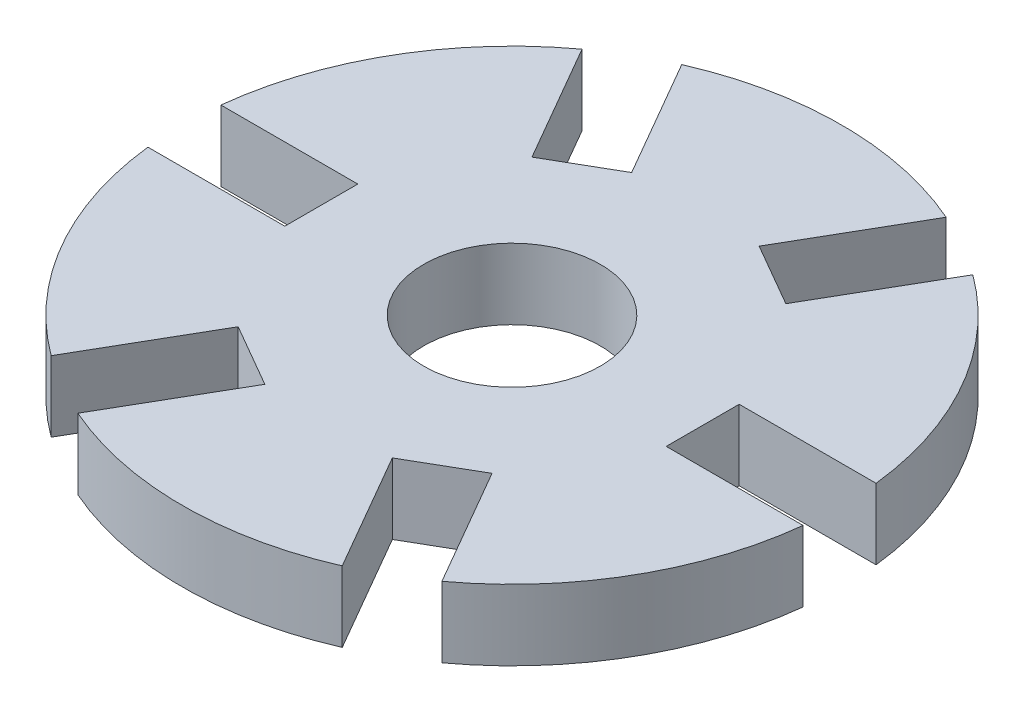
ISO-10303-21;
HEADER;
FILE_DESCRIPTION(('STEP AP214'),'2;1');
FILE_NAME('part.step','',(''),(''),'','','');
FILE_SCHEMA(('AUTOMOTIVE_DESIGN { 1 0 10303 214 1 1 1 1 }'));
ENDSEC;
DATA;
#1=APPLICATION_CONTEXT('core data for automotive mechanical design processes');
#2=APPLICATION_PROTOCOL_DEFINITION('international standard','automotive_design',2000,#1);
#3=PRODUCT_CONTEXT('',#1,'mechanical');
#4=PRODUCT('Part','Part','',(#3));
#5=PRODUCT_RELATED_PRODUCT_CATEGORY('part','',(#4));
#6=PRODUCT_DEFINITION_FORMATION('','',#4);
#7=PRODUCT_DEFINITION_CONTEXT('part definition',#1,'design');
#8=PRODUCT_DEFINITION('design','',#6,#7);
#9=PRODUCT_DEFINITION_SHAPE('','',#8);
#10=(LENGTH_UNIT() NAMED_UNIT(*) SI_UNIT(.MILLI.,.METRE.));
#11=(NAMED_UNIT(*) PLANE_ANGLE_UNIT() SI_UNIT($,.RADIAN.));
#12=(NAMED_UNIT(*) SI_UNIT($,.STERADIAN.) SOLID_ANGLE_UNIT());
#13=UNCERTAINTY_MEASURE_WITH_UNIT(LENGTH_MEASURE(1.E-05),#10,'distance_accuracy_value','');
#14=(GEOMETRIC_REPRESENTATION_CONTEXT(3) GLOBAL_UNCERTAINTY_ASSIGNED_CONTEXT((#13)) GLOBAL_UNIT_ASSIGNED_CONTEXT((#10,
#11,#12)) REPRESENTATION_CONTEXT('',''));
#15=CARTESIAN_POINT('',(0.,0.,0.));
#16=DIRECTION('',(0.,0.,1.));
#17=DIRECTION('',(1.,0.,0.));
#18=AXIS2_PLACEMENT_3D('',#15,#16,#17);
#19=CARTESIAN_POINT('',(0.,6.,0.));
#20=DIRECTION('',(0.,-1.,0.));
#21=DIRECTION('',(0.,0.,-1.));
#22=AXIS2_PLACEMENT_3D('',#19,#20,#21);
#23=CYLINDRICAL_SURFACE('',#22,28.);
#24=CARTESIAN_POINT('',(0.,6.,0.));
#25=DIRECTION('',(0.,1.,0.));
#26=DIRECTION('',(0.,0.,-1.));
#27=AXIS2_PLACEMENT_3D('',#24,#25,#26);
#28=CIRCLE('',#27,28.);
#29=CARTESIAN_POINT('',(16.5986106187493,6.,22.5496369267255));
#30=VERTEX_POINT('',#29);
#31=CARTESIAN_POINT('',(27.8278637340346,6.,3.1));
#32=VERTEX_POINT('',#31);
#33=EDGE_CURVE('E57',#30,#32,#28,.T.);
#34=ORIENTED_EDGE('',*,*,#33,.F.);
#35=DIRECTION('',(0.,-1.,0.));
#36=VECTOR('',#35,1.);
#37=CARTESIAN_POINT('',(16.5986106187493,6.,22.5496369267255));
#38=LINE('',#37,#36);
#39=CARTESIAN_POINT('',(16.5986106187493,0.,22.5496369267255));
#40=VERTEX_POINT('',#39);
#41=EDGE_CURVE('E297',#40,#30,#38,.F.);
#42=ORIENTED_EDGE('',*,*,#41,.F.);
#43=CARTESIAN_POINT('',(0.,0.,0.));
#44=DIRECTION('',(0.,1.,0.));
#45=DIRECTION('',(0.,0.,-1.));
#46=AXIS2_PLACEMENT_3D('',#43,#44,#45);
#47=CIRCLE('',#46,28.);
#48=CARTESIAN_POINT('',(27.8278637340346,0.,3.1));
#49=VERTEX_POINT('',#48);
#50=EDGE_CURVE('E387',#40,#49,#47,.T.);
#51=ORIENTED_EDGE('',*,*,#50,.T.);
#52=DIRECTION('',(0.,-1.,0.));
#53=VECTOR('',#52,1.);
#54=CARTESIAN_POINT('',(27.8278637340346,6.,3.1));
#55=LINE('',#54,#53);
#56=EDGE_CURVE('E354',#32,#49,#55,.T.);
#57=ORIENTED_EDGE('',*,*,#56,.F.);
#58=EDGE_LOOP('',(#34,#42,#51,#57));
#59=FACE_BOUND('',#58,.T.);
#60=ADVANCED_FACE('F46',(#59),#23,.T.);
#61=CARTESIAN_POINT('',(-11.2292531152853,0.,25.6496369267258));
#62=VERTEX_POINT('',#61);
#63=CARTESIAN_POINT('',(11.2292531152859,0.,25.6496369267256));
#64=VERTEX_POINT('',#63);
#65=EDGE_CURVE('E390',#62,#64,#47,.T.);
#66=ORIENTED_EDGE('',*,*,#65,.T.);
#67=DIRECTION('',(0.,-1.,0.));
#68=VECTOR('',#67,1.);
#69=CARTESIAN_POINT('',(11.2292531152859,6.,25.6496369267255));
#70=LINE('',#69,#68);
#71=CARTESIAN_POINT('',(11.2292531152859,6.,25.6496369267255));
#72=VERTEX_POINT('',#71);
#73=EDGE_CURVE('E295',#72,#64,#70,.T.);
#74=ORIENTED_EDGE('',*,*,#73,.F.);
#75=CARTESIAN_POINT('',(-11.2292531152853,6.,25.6496369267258));
#76=VERTEX_POINT('',#75);
#77=EDGE_CURVE('E424',#76,#72,#28,.T.);
#78=ORIENTED_EDGE('',*,*,#77,.F.);
#79=DIRECTION('',(0.,-1.,0.));
#80=VECTOR('',#79,1.);
#81=CARTESIAN_POINT('',(-11.2292531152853,6.,25.6496369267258));
#82=LINE('',#81,#80);
#83=EDGE_CURVE('E449',#62,#76,#82,.F.);
#84=ORIENTED_EDGE('',*,*,#83,.F.);
#85=EDGE_LOOP('',(#66,#74,#78,#84));
#86=FACE_BOUND('',#85,.T.);
#87=ADVANCED_FACE('F408',(#86),#23,.T.);
#88=CARTESIAN_POINT('',(-27.8278637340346,0.,3.1));
#89=VERTEX_POINT('',#88);
#90=CARTESIAN_POINT('',(-16.5986106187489,0.,22.5496369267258));
#91=VERTEX_POINT('',#90);
#92=EDGE_CURVE('E434',#89,#91,#47,.T.);
#93=ORIENTED_EDGE('',*,*,#92,.T.);
#94=DIRECTION('',(0.,-1.,0.));
#95=VECTOR('',#94,1.);
#96=CARTESIAN_POINT('',(-16.5986106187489,6.,22.5496369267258));
#97=LINE('',#96,#95);
#98=CARTESIAN_POINT('',(-16.5986106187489,6.,22.5496369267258));
#99=VERTEX_POINT('',#98);
#100=EDGE_CURVE('E324',#99,#91,#97,.T.);
#101=ORIENTED_EDGE('',*,*,#100,.F.);
#102=CARTESIAN_POINT('',(-27.8278637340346,6.,3.1));
#103=VERTEX_POINT('',#102);
#104=EDGE_CURVE('E245',#103,#99,#28,.T.);
#105=ORIENTED_EDGE('',*,*,#104,.F.);
#106=DIRECTION('',(0.,-1.,0.));
#107=VECTOR('',#106,1.);
#108=CARTESIAN_POINT('',(-27.8278637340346,6.,3.1));
#109=LINE('',#108,#107);
#110=EDGE_CURVE('E496',#89,#103,#109,.F.);
#111=ORIENTED_EDGE('',*,*,#110,.F.);
#112=EDGE_LOOP('',(#93,#101,#105,#111));
#113=FACE_BOUND('',#112,.T.);
#114=ADVANCED_FACE('F414',(#113),#23,.T.);
#115=CARTESIAN_POINT('',(-16.5986106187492,0.,-22.5496369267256));
#116=VERTEX_POINT('',#115);
#117=CARTESIAN_POINT('',(-27.8278637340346,0.,-3.1));
#118=VERTEX_POINT('',#117);
#119=EDGE_CURVE('E432',#116,#118,#47,.T.);
#120=ORIENTED_EDGE('',*,*,#119,.T.);
#121=DIRECTION('',(0.,-1.,0.));
#122=VECTOR('',#121,1.);
#123=CARTESIAN_POINT('',(-27.8278637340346,6.,-3.1));
#124=LINE('',#123,#122);
#125=CARTESIAN_POINT('',(-27.8278637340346,6.,-3.1));
#126=VERTEX_POINT('',#125);
#127=EDGE_CURVE('E294',#126,#118,#124,.T.);
#128=ORIENTED_EDGE('',*,*,#127,.F.);
#129=CARTESIAN_POINT('',(-16.5986106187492,6.,-22.5496369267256));
#130=VERTEX_POINT('',#129);
#131=EDGE_CURVE('E241',#130,#126,#28,.T.);
#132=ORIENTED_EDGE('',*,*,#131,.F.);
#133=DIRECTION('',(0.,-1.,0.));
#134=VECTOR('',#133,1.);
#135=CARTESIAN_POINT('',(-16.5986106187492,6.,-22.5496369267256));
#136=LINE('',#135,#134);
#137=EDGE_CURVE('E231',#116,#130,#136,.F.);
#138=ORIENTED_EDGE('',*,*,#137,.F.);
#139=EDGE_LOOP('',(#120,#128,#132,#138));
#140=FACE_BOUND('',#139,.T.);
#141=ADVANCED_FACE('F533',(#140),#23,.T.);
#142=CARTESIAN_POINT('',(11.2292531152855,0.,-25.6496369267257));
#143=VERTEX_POINT('',#142);
#144=CARTESIAN_POINT('',(-11.2292531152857,0.,-25.6496369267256));
#145=VERTEX_POINT('',#144);
#146=EDGE_CURVE('E230',#143,#145,#47,.T.);
#147=ORIENTED_EDGE('',*,*,#146,.T.);
#148=DIRECTION('',(0.,-1.,0.));
#149=VECTOR('',#148,1.);
#150=CARTESIAN_POINT('',(-11.2292531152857,6.,-25.6496369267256));
#151=LINE('',#150,#149);
#152=CARTESIAN_POINT('',(-11.2292531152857,6.,-25.6496369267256));
#153=VERTEX_POINT('',#152);
#154=EDGE_CURVE('E212',#153,#145,#151,.T.);
#155=ORIENTED_EDGE('',*,*,#154,.F.);
#156=CARTESIAN_POINT('',(11.2292531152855,6.,-25.6496369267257));
#157=VERTEX_POINT('',#156);
#158=EDGE_CURVE('E56',#157,#153,#28,.T.);
#159=ORIENTED_EDGE('',*,*,#158,.F.);
#160=DIRECTION('',(0.,-1.,0.));
#161=VECTOR('',#160,1.);
#162=CARTESIAN_POINT('',(11.2292531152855,6.,-25.6496369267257));
#163=LINE('',#162,#161);
#164=EDGE_CURVE('E327',#143,#157,#163,.F.);
#165=ORIENTED_EDGE('',*,*,#164,.F.);
#166=EDGE_LOOP('',(#147,#155,#159,#165));
#167=FACE_BOUND('',#166,.T.);
#168=ADVANCED_FACE('F227',(#167),#23,.T.);
#169=CARTESIAN_POINT('',(27.8278637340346,0.,-3.1));
#170=VERTEX_POINT('',#169);
#171=CARTESIAN_POINT('',(16.598610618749,0.,-22.5496369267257));
#172=VERTEX_POINT('',#171);
#173=EDGE_CURVE('E50',#170,#172,#47,.T.);
#174=ORIENTED_EDGE('',*,*,#173,.T.);
#175=DIRECTION('',(0.,-1.,0.));
#176=VECTOR('',#175,1.);
#177=CARTESIAN_POINT('',(16.598610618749,6.,-22.5496369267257));
#178=LINE('',#177,#176);
#179=CARTESIAN_POINT('',(16.598610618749,6.,-22.5496369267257));
#180=VERTEX_POINT('',#179);
#181=EDGE_CURVE('E325',#180,#172,#178,.T.);
#182=ORIENTED_EDGE('',*,*,#181,.F.);
#183=CARTESIAN_POINT('',(27.8278637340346,6.,-3.1));
#184=VERTEX_POINT('',#183);
#185=EDGE_CURVE('E12',#184,#180,#28,.T.);
#186=ORIENTED_EDGE('',*,*,#185,.F.);
#187=DIRECTION('',(0.,-1.,0.));
#188=VECTOR('',#187,1.);
#189=CARTESIAN_POINT('',(27.8278637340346,6.,-3.1));
#190=LINE('',#189,#188);
#191=EDGE_CURVE('E357',#170,#184,#190,.F.);
#192=ORIENTED_EDGE('',*,*,#191,.F.);
#193=EDGE_LOOP('',(#174,#182,#186,#192));
#194=FACE_BOUND('',#193,.T.);
#195=ADVANCED_FACE('F48',(#194),#23,.T.);
#196=CARTESIAN_POINT('',(0.,6.,0.));
#197=DIRECTION('',(0.,-1.,0.));
#198=DIRECTION('',(0.,0.,-1.));
#199=AXIS2_PLACEMENT_3D('',#196,#197,#198);
#200=PLANE('',#199);
#201=CARTESIAN_POINT('',(0.,6.,0.));
#202=DIRECTION('',(0.,1.,0.));
#203=DIRECTION('',(0.,0.,1.));
#204=AXIS2_PLACEMENT_3D('',#201,#202,#203);
#205=CIRCLE('',#204,7.5);
#206=CARTESIAN_POINT('',(0.,6.,7.5));
#207=VERTEX_POINT('',#206);
#208=EDGE_CURVE('E248',#207,#207,#205,.T.);
#209=ORIENTED_EDGE('',*,*,#208,.F.);
#210=EDGE_LOOP('',(#209));
#211=FACE_BOUND('',#210,.T.);
#212=DIRECTION('',(-0.866025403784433,0.,0.50000000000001));
#213=VECTOR('',#212,1.);
#214=CARTESIAN_POINT('',(10.7846787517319,6.,12.4796115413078));
#215=LINE('',#214,#213);
#216=CARTESIAN_POINT('',(10.7846787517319,6.,12.4796115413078));
#217=VERTEX_POINT('',#216);
#218=CARTESIAN_POINT('',(5.41532124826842,6.,15.5796115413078));
#219=VERTEX_POINT('',#218);
#220=EDGE_CURVE('E305',#217,#219,#215,.T.);
#221=ORIENTED_EDGE('',*,*,#220,.F.);
#222=DIRECTION('',(-0.50000000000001,0.,-0.866025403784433));
#223=VECTOR('',#222,1.);
#224=CARTESIAN_POINT('',(10.7846787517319,6.,12.4796115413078));
#225=LINE('',#224,#223);
#226=EDGE_CURVE('E314',#30,#217,#225,.T.);
#227=ORIENTED_EDGE('',*,*,#226,.F.);
#228=ORIENTED_EDGE('',*,*,#33,.T.);
#229=DIRECTION('',(1.,0.,0.));
#230=VECTOR('',#229,1.);
#231=CARTESIAN_POINT('',(16.2,6.,3.1));
#232=LINE('',#231,#230);
#233=CARTESIAN_POINT('',(16.2,6.,3.1));
#234=VERTEX_POINT('',#233);
#235=EDGE_CURVE('E370',#234,#32,#232,.T.);
#236=ORIENTED_EDGE('',*,*,#235,.F.);
#237=DIRECTION('',(0.,0.,1.));
#238=VECTOR('',#237,1.);
#239=CARTESIAN_POINT('',(16.2,6.,-3.1));
#240=LINE('',#239,#238);
#241=CARTESIAN_POINT('',(16.2,6.,-3.1));
#242=VERTEX_POINT('',#241);
#243=EDGE_CURVE('E365',#242,#234,#240,.T.);
#244=ORIENTED_EDGE('',*,*,#243,.F.);
#245=DIRECTION('',(-1.,0.,0.));
#246=VECTOR('',#245,1.);
#247=CARTESIAN_POINT('',(16.2,6.,-3.1));
#248=LINE('',#247,#246);
#249=EDGE_CURVE('E374',#184,#242,#248,.T.);
#250=ORIENTED_EDGE('',*,*,#249,.F.);
#251=ORIENTED_EDGE('',*,*,#185,.T.);
#252=DIRECTION('',(0.499999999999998,0.,-0.86602540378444));
#253=VECTOR('',#252,1.);
#254=CARTESIAN_POINT('',(10.7846787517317,6.,-12.4796115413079));
#255=LINE('',#254,#253);
#256=CARTESIAN_POINT('',(10.7846787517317,6.,-12.4796115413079));
#257=VERTEX_POINT('',#256);
#258=EDGE_CURVE('E341',#257,#180,#255,.T.);
#259=ORIENTED_EDGE('',*,*,#258,.F.);
#260=DIRECTION('',(0.86602540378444,0.,0.499999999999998));
#261=VECTOR('',#260,1.);
#262=CARTESIAN_POINT('',(5.4153212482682,6.,-15.5796115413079));
#263=LINE('',#262,#261);
#264=CARTESIAN_POINT('',(5.4153212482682,6.,-15.5796115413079));
#265=VERTEX_POINT('',#264);
#266=EDGE_CURVE('E336',#265,#257,#263,.T.);
#267=ORIENTED_EDGE('',*,*,#266,.F.);
#268=DIRECTION('',(-0.499999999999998,0.,0.86602540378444));
#269=VECTOR('',#268,1.);
#270=CARTESIAN_POINT('',(5.4153212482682,6.,-15.5796115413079));
#271=LINE('',#270,#269);
#272=EDGE_CURVE('E239',#157,#265,#271,.T.);
#273=ORIENTED_EDGE('',*,*,#272,.F.);
#274=ORIENTED_EDGE('',*,*,#158,.T.);
#275=DIRECTION('',(-0.500000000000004,0.,-0.866025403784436));
#276=VECTOR('',#275,1.);
#277=CARTESIAN_POINT('',(-5.41532124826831,6.,-15.5796115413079));
#278=LINE('',#277,#276);
#279=CARTESIAN_POINT('',(-5.41532124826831,6.,-15.5796115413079));
#280=VERTEX_POINT('',#279);
#281=EDGE_CURVE('E209',#280,#153,#278,.T.);
#282=ORIENTED_EDGE('',*,*,#281,.F.);
#283=DIRECTION('',(0.866025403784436,0.,-0.500000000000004));
#284=VECTOR('',#283,1.);
#285=CARTESIAN_POINT('',(-10.7846787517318,6.,-12.4796115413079));
#286=LINE('',#285,#284);
#287=CARTESIAN_POINT('',(-10.7846787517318,6.,-12.4796115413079));
#288=VERTEX_POINT('',#287);
#289=EDGE_CURVE('E222',#288,#280,#286,.T.);
#290=ORIENTED_EDGE('',*,*,#289,.F.);
#291=DIRECTION('',(0.500000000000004,0.,0.866025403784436));
#292=VECTOR('',#291,1.);
#293=CARTESIAN_POINT('',(-10.7846787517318,6.,-12.4796115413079));
#294=LINE('',#293,#292);
#295=EDGE_CURVE('E221',#130,#288,#294,.T.);
#296=ORIENTED_EDGE('',*,*,#295,.F.);
#297=ORIENTED_EDGE('',*,*,#131,.T.);
#298=DIRECTION('',(-1.,0.,0.));
#299=VECTOR('',#298,1.);
#300=CARTESIAN_POINT('',(-16.2,6.,-3.1));
#301=LINE('',#300,#299);
#302=CARTESIAN_POINT('',(-16.2,6.,-3.1));
#303=VERTEX_POINT('',#302);
#304=EDGE_CURVE('E468',#303,#126,#301,.T.);
#305=ORIENTED_EDGE('',*,*,#304,.F.);
#306=DIRECTION('',(0.,0.,-1.));
#307=VECTOR('',#306,1.);
#308=CARTESIAN_POINT('',(-16.2,6.,3.1));
#309=LINE('',#308,#307);
#310=CARTESIAN_POINT('',(-16.2,6.,3.1));
#311=VERTEX_POINT('',#310);
#312=EDGE_CURVE('E469',#311,#303,#309,.T.);
#313=ORIENTED_EDGE('',*,*,#312,.F.);
#314=DIRECTION('',(1.,0.,0.));
#315=VECTOR('',#314,1.);
#316=CARTESIAN_POINT('',(-16.2,6.,3.1));
#317=LINE('',#316,#315);
#318=EDGE_CURVE('E464',#103,#311,#317,.T.);
#319=ORIENTED_EDGE('',*,*,#318,.F.);
#320=ORIENTED_EDGE('',*,*,#104,.T.);
#321=DIRECTION('',(-0.499999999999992,0.,0.866025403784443));
#322=VECTOR('',#321,1.);
#323=CARTESIAN_POINT('',(-10.7846787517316,6.,12.479611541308));
#324=LINE('',#323,#322);
#325=CARTESIAN_POINT('',(-10.7846787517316,6.,12.479611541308));
#326=VERTEX_POINT('',#325);
#327=EDGE_CURVE('E277',#326,#99,#324,.T.);
#328=ORIENTED_EDGE('',*,*,#327,.F.);
#329=DIRECTION('',(-0.866025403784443,0.,-0.499999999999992));
#330=VECTOR('',#329,1.);
#331=CARTESIAN_POINT('',(-5.4153212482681,6.,15.579611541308));
#332=LINE('',#331,#330);
#333=CARTESIAN_POINT('',(-5.4153212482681,6.,15.579611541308));
#334=VERTEX_POINT('',#333);
#335=EDGE_CURVE('E282',#334,#326,#332,.T.);
#336=ORIENTED_EDGE('',*,*,#335,.F.);
#337=DIRECTION('',(0.499999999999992,0.,-0.866025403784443));
#338=VECTOR('',#337,1.);
#339=CARTESIAN_POINT('',(-5.4153212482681,6.,15.579611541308));
#340=LINE('',#339,#338);
#341=EDGE_CURVE('E281',#76,#334,#340,.T.);
#342=ORIENTED_EDGE('',*,*,#341,.F.);
#343=ORIENTED_EDGE('',*,*,#77,.T.);
#344=DIRECTION('',(0.50000000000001,0.,0.866025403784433));
#345=VECTOR('',#344,1.);
#346=CARTESIAN_POINT('',(5.41532124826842,6.,15.5796115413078));
#347=LINE('',#346,#345);
#348=EDGE_CURVE('E309',#219,#72,#347,.T.);
#349=ORIENTED_EDGE('',*,*,#348,.F.);
#350=EDGE_LOOP('',(#221,#227,#228,#236,#244,#250,#251,#259,#267,#273,#274,#282,#290,#296,#297,
#305,#313,#319,#320,#328,#336,#342,#343,#349));
#351=FACE_BOUND('',#350,.T.);
#352=ADVANCED_FACE('F236',(#211,#351),#200,.F.);
#353=CARTESIAN_POINT('',(0.,0.,0.));
#354=DIRECTION('',(0.,-1.,0.));
#355=DIRECTION('',(0.,0.,-1.));
#356=AXIS2_PLACEMENT_3D('',#353,#354,#355);
#357=PLANE('',#356);
#358=DIRECTION('',(-0.50000000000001,0.,-0.866025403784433));
#359=VECTOR('',#358,1.);
#360=CARTESIAN_POINT('',(10.7846787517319,0.,12.4796115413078));
#361=LINE('',#360,#359);
#362=CARTESIAN_POINT('',(10.7846787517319,0.,12.4796115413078));
#363=VERTEX_POINT('',#362);
#364=EDGE_CURVE('E302',#40,#363,#361,.T.);
#365=ORIENTED_EDGE('',*,*,#364,.T.);
#366=DIRECTION('',(-0.866025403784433,0.,0.50000000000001));
#367=VECTOR('',#366,1.);
#368=CARTESIAN_POINT('',(10.7846787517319,0.,12.4796115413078));
#369=LINE('',#368,#367);
#370=CARTESIAN_POINT('',(5.41532124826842,0.,15.5796115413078));
#371=VERTEX_POINT('',#370);
#372=EDGE_CURVE('E299',#363,#371,#369,.T.);
#373=ORIENTED_EDGE('',*,*,#372,.T.);
#374=DIRECTION('',(0.50000000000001,0.,0.866025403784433));
#375=VECTOR('',#374,1.);
#376=CARTESIAN_POINT('',(5.41532124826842,0.,15.5796115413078));
#377=LINE('',#376,#375);
#378=EDGE_CURVE('E64',#371,#64,#377,.T.);
#379=ORIENTED_EDGE('',*,*,#378,.T.);
#380=ORIENTED_EDGE('',*,*,#65,.F.);
#381=DIRECTION('',(0.499999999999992,0.,-0.866025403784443));
#382=VECTOR('',#381,1.);
#383=CARTESIAN_POINT('',(-5.4153212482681,0.,15.579611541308));
#384=LINE('',#383,#382);
#385=CARTESIAN_POINT('',(-5.4153212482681,0.,15.579611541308));
#386=VERTEX_POINT('',#385);
#387=EDGE_CURVE('E452',#62,#386,#384,.T.);
#388=ORIENTED_EDGE('',*,*,#387,.T.);
#389=DIRECTION('',(-0.866025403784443,0.,-0.499999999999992));
#390=VECTOR('',#389,1.);
#391=CARTESIAN_POINT('',(-5.4153212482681,0.,15.579611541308));
#392=LINE('',#391,#390);
#393=CARTESIAN_POINT('',(-10.7846787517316,0.,12.479611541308));
#394=VERTEX_POINT('',#393);
#395=EDGE_CURVE('E513',#386,#394,#392,.T.);
#396=ORIENTED_EDGE('',*,*,#395,.T.);
#397=DIRECTION('',(-0.499999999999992,0.,0.866025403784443));
#398=VECTOR('',#397,1.);
#399=CARTESIAN_POINT('',(-10.7846787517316,0.,12.479611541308));
#400=LINE('',#399,#398);
#401=EDGE_CURVE('E72',#394,#91,#400,.T.);
#402=ORIENTED_EDGE('',*,*,#401,.T.);
#403=ORIENTED_EDGE('',*,*,#92,.F.);
#404=DIRECTION('',(1.,0.,0.));
#405=VECTOR('',#404,1.);
#406=CARTESIAN_POINT('',(-16.2,0.,3.1));
#407=LINE('',#406,#405);
#408=CARTESIAN_POINT('',(-16.2,0.,3.1));
#409=VERTEX_POINT('',#408);
#410=EDGE_CURVE('E472',#89,#409,#407,.T.);
#411=ORIENTED_EDGE('',*,*,#410,.T.);
#412=DIRECTION('',(0.,0.,-1.));
#413=VECTOR('',#412,1.);
#414=CARTESIAN_POINT('',(-16.2,0.,3.1));
#415=LINE('',#414,#413);
#416=CARTESIAN_POINT('',(-16.2,0.,-3.1));
#417=VERTEX_POINT('',#416);
#418=EDGE_CURVE('E498',#409,#417,#415,.T.);
#419=ORIENTED_EDGE('',*,*,#418,.T.);
#420=DIRECTION('',(-1.,0.,0.));
#421=VECTOR('',#420,1.);
#422=CARTESIAN_POINT('',(-16.2,0.,-3.1));
#423=LINE('',#422,#421);
#424=EDGE_CURVE('E232',#417,#118,#423,.T.);
#425=ORIENTED_EDGE('',*,*,#424,.T.);
#426=ORIENTED_EDGE('',*,*,#119,.F.);
#427=DIRECTION('',(0.500000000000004,0.,0.866025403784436));
#428=VECTOR('',#427,1.);
#429=CARTESIAN_POINT('',(-10.7846787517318,0.,-12.4796115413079));
#430=LINE('',#429,#428);
#431=CARTESIAN_POINT('',(-10.7846787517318,0.,-12.4796115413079));
#432=VERTEX_POINT('',#431);
#433=EDGE_CURVE('E479',#116,#432,#430,.T.);
#434=ORIENTED_EDGE('',*,*,#433,.T.);
#435=DIRECTION('',(0.866025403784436,0.,-0.500000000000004));
#436=VECTOR('',#435,1.);
#437=CARTESIAN_POINT('',(-10.7846787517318,0.,-12.4796115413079));
#438=LINE('',#437,#436);
#439=CARTESIAN_POINT('',(-5.41532124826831,0.,-15.5796115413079));
#440=VERTEX_POINT('',#439);
#441=EDGE_CURVE('E483',#432,#440,#438,.T.);
#442=ORIENTED_EDGE('',*,*,#441,.T.);
#443=DIRECTION('',(-0.500000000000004,0.,-0.866025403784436));
#444=VECTOR('',#443,1.);
#445=CARTESIAN_POINT('',(-5.41532124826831,0.,-15.5796115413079));
#446=LINE('',#445,#444);
#447=EDGE_CURVE('E328',#440,#145,#446,.T.);
#448=ORIENTED_EDGE('',*,*,#447,.T.);
#449=ORIENTED_EDGE('',*,*,#146,.F.);
#450=DIRECTION('',(-0.499999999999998,0.,0.86602540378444));
#451=VECTOR('',#450,1.);
#452=CARTESIAN_POINT('',(5.4153212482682,0.,-15.5796115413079));
#453=LINE('',#452,#451);
#454=CARTESIAN_POINT('',(5.4153212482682,0.,-15.5796115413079));
#455=VERTEX_POINT('',#454);
#456=EDGE_CURVE('E333',#143,#455,#453,.T.);
#457=ORIENTED_EDGE('',*,*,#456,.T.);
#458=DIRECTION('',(0.86602540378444,0.,0.499999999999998));
#459=VECTOR('',#458,1.);
#460=CARTESIAN_POINT('',(5.4153212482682,0.,-15.5796115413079));
#461=LINE('',#460,#459);
#462=CARTESIAN_POINT('',(10.7846787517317,0.,-12.4796115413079));
#463=VERTEX_POINT('',#462);
#464=EDGE_CURVE('E330',#455,#463,#461,.T.);
#465=ORIENTED_EDGE('',*,*,#464,.T.);
#466=DIRECTION('',(0.499999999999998,0.,-0.86602540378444));
#467=VECTOR('',#466,1.);
#468=CARTESIAN_POINT('',(10.7846787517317,0.,-12.4796115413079));
#469=LINE('',#468,#467);
#470=EDGE_CURVE('E350',#463,#172,#469,.T.);
#471=ORIENTED_EDGE('',*,*,#470,.T.);
#472=ORIENTED_EDGE('',*,*,#173,.F.);
#473=DIRECTION('',(-1.,0.,0.));
#474=VECTOR('',#473,1.);
#475=CARTESIAN_POINT('',(16.2,0.,-3.1));
#476=LINE('',#475,#474);
#477=CARTESIAN_POINT('',(16.2,0.,-3.1));
#478=VERTEX_POINT('',#477);
#479=EDGE_CURVE('E362',#170,#478,#476,.T.);
#480=ORIENTED_EDGE('',*,*,#479,.T.);
#481=DIRECTION('',(0.,0.,1.));
#482=VECTOR('',#481,1.);
#483=CARTESIAN_POINT('',(16.2,0.,-3.1));
#484=LINE('',#483,#482);
#485=CARTESIAN_POINT('',(16.2,0.,3.1));
#486=VERTEX_POINT('',#485);
#487=EDGE_CURVE('E359',#478,#486,#484,.T.);
#488=ORIENTED_EDGE('',*,*,#487,.T.);
#489=DIRECTION('',(1.,0.,0.));
#490=VECTOR('',#489,1.);
#491=CARTESIAN_POINT('',(16.2,0.,3.1));
#492=LINE('',#491,#490);
#493=EDGE_CURVE('E382',#486,#49,#492,.T.);
#494=ORIENTED_EDGE('',*,*,#493,.T.);
#495=ORIENTED_EDGE('',*,*,#50,.F.);
#496=EDGE_LOOP('',(#365,#373,#379,#380,#388,#396,#402,#403,#411,#419,#425,#426,#434,#442,#448,
#449,#457,#465,#471,#472,#480,#488,#494,#495));
#497=FACE_BOUND('',#496,.T.);
#498=CARTESIAN_POINT('',(0.,0.,0.));
#499=DIRECTION('',(0.,1.,0.));
#500=DIRECTION('',(0.,0.,1.));
#501=AXIS2_PLACEMENT_3D('',#498,#499,#500);
#502=CIRCLE('',#501,7.5);
#503=CARTESIAN_POINT('',(0.,0.,7.5));
#504=VERTEX_POINT('',#503);
#505=EDGE_CURVE('E385',#504,#504,#502,.T.);
#506=ORIENTED_EDGE('',*,*,#505,.T.);
#507=EDGE_LOOP('',(#506));
#508=FACE_BOUND('',#507,.T.);
#509=ADVANCED_FACE('F398',(#497,#508),#357,.T.);
#510=CARTESIAN_POINT('',(0.,0.,0.));
#511=DIRECTION('',(0.,1.,0.));
#512=DIRECTION('',(0.,0.,1.));
#513=AXIS2_PLACEMENT_3D('',#510,#511,#512);
#514=CYLINDRICAL_SURFACE('',#513,7.5);
#515=ORIENTED_EDGE('',*,*,#505,.F.);
#516=EDGE_LOOP('',(#515));
#517=FACE_BOUND('',#516,.T.);
#518=ORIENTED_EDGE('',*,*,#208,.T.);
#519=EDGE_LOOP('',(#518));
#520=FACE_BOUND('',#519,.T.);
#521=ADVANCED_FACE('F395',(#517,#520),#514,.F.);
#522=CARTESIAN_POINT('',(16.2,-0.00100000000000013,-3.1));
#523=DIRECTION('',(0.,0.,-1.));
#524=DIRECTION('',(-1.,0.,0.));
#525=AXIS2_PLACEMENT_3D('',#522,#523,#524);
#526=PLANE('',#525);
#527=ORIENTED_EDGE('',*,*,#191,.T.);
#528=ORIENTED_EDGE('',*,*,#249,.T.);
#529=DIRECTION('',(0.,1.,0.));
#530=VECTOR('',#529,1.);
#531=CARTESIAN_POINT('',(16.2,-0.00100000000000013,-3.1));
#532=LINE('',#531,#530);
#533=EDGE_CURVE('E380',#478,#242,#532,.T.);
#534=ORIENTED_EDGE('',*,*,#533,.F.);
#535=ORIENTED_EDGE('',*,*,#479,.F.);
#536=EDGE_LOOP('',(#527,#528,#534,#535));
#537=FACE_BOUND('',#536,.T.);
#538=ADVANCED_FACE('F584',(#537),#526,.F.);
#539=CARTESIAN_POINT('',(16.2,-0.00100000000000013,3.1));
#540=DIRECTION('',(0.,0.,1.));
#541=DIRECTION('',(1.,0.,0.));
#542=AXIS2_PLACEMENT_3D('',#539,#540,#541);
#543=PLANE('',#542);
#544=ORIENTED_EDGE('',*,*,#56,.T.);
#545=ORIENTED_EDGE('',*,*,#493,.F.);
#546=DIRECTION('',(0.,1.,0.));
#547=VECTOR('',#546,1.);
#548=CARTESIAN_POINT('',(16.2,-0.00100000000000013,3.1));
#549=LINE('',#548,#547);
#550=EDGE_CURVE('E379',#486,#234,#549,.T.);
#551=ORIENTED_EDGE('',*,*,#550,.T.);
#552=ORIENTED_EDGE('',*,*,#235,.T.);
#553=EDGE_LOOP('',(#544,#545,#551,#552));
#554=FACE_BOUND('',#553,.T.);
#555=ADVANCED_FACE('F587',(#554),#543,.F.);
#556=CARTESIAN_POINT('',(16.2,-0.00100000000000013,-3.1));
#557=DIRECTION('',(-1.,0.,0.));
#558=DIRECTION('',(0.,0.,1.));
#559=AXIS2_PLACEMENT_3D('',#556,#557,#558);
#560=PLANE('',#559);
#561=ORIENTED_EDGE('',*,*,#533,.T.);
#562=ORIENTED_EDGE('',*,*,#243,.T.);
#563=ORIENTED_EDGE('',*,*,#550,.F.);
#564=ORIENTED_EDGE('',*,*,#487,.F.);
#565=EDGE_LOOP('',(#561,#562,#563,#564));
#566=FACE_BOUND('',#565,.T.);
#567=ADVANCED_FACE('F575',(#566),#560,.F.);
#568=CARTESIAN_POINT('',(5.4153212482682,-0.00100000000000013,-15.5796115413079));
#569=DIRECTION('',(-0.86602540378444,0.,-0.499999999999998));
#570=DIRECTION('',(-0.499999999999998,0.,0.86602540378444));
#571=AXIS2_PLACEMENT_3D('',#568,#569,#570);
#572=PLANE('',#571);
#573=ORIENTED_EDGE('',*,*,#164,.T.);
#574=ORIENTED_EDGE('',*,*,#272,.T.);
#575=DIRECTION('',(0.,1.,0.));
#576=VECTOR('',#575,1.);
#577=CARTESIAN_POINT('',(5.4153212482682,-0.00100000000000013,-15.5796115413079));
#578=LINE('',#577,#576);
#579=EDGE_CURVE('E348',#455,#265,#578,.T.);
#580=ORIENTED_EDGE('',*,*,#579,.F.);
#581=ORIENTED_EDGE('',*,*,#456,.F.);
#582=EDGE_LOOP('',(#573,#574,#580,#581));
#583=FACE_BOUND('',#582,.T.);
#584=ADVANCED_FACE('F571',(#583),#572,.F.);
#585=CARTESIAN_POINT('',(10.7846787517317,-0.00100000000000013,-12.4796115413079));
#586=DIRECTION('',(0.86602540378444,0.,0.499999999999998));
#587=DIRECTION('',(0.499999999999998,0.,-0.86602540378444));
#588=AXIS2_PLACEMENT_3D('',#585,#586,#587);
#589=PLANE('',#588);
#590=ORIENTED_EDGE('',*,*,#181,.T.);
#591=ORIENTED_EDGE('',*,*,#470,.F.);
#592=DIRECTION('',(0.,1.,0.));
#593=VECTOR('',#592,1.);
#594=CARTESIAN_POINT('',(10.7846787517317,-0.00100000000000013,-12.4796115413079));
#595=LINE('',#594,#593);
#596=EDGE_CURVE('E347',#463,#257,#595,.T.);
#597=ORIENTED_EDGE('',*,*,#596,.T.);
#598=ORIENTED_EDGE('',*,*,#258,.T.);
#599=EDGE_LOOP('',(#590,#591,#597,#598));
#600=FACE_BOUND('',#599,.T.);
#601=ADVANCED_FACE('F574',(#600),#589,.F.);
#602=CARTESIAN_POINT('',(5.4153212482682,-0.00100000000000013,-15.5796115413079));
#603=DIRECTION('',(-0.499999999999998,0.,0.86602540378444));
#604=DIRECTION('',(0.86602540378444,0.,0.499999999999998));
#605=AXIS2_PLACEMENT_3D('',#602,#603,#604);
#606=PLANE('',#605);
#607=ORIENTED_EDGE('',*,*,#579,.T.);
#608=ORIENTED_EDGE('',*,*,#266,.T.);
#609=ORIENTED_EDGE('',*,*,#596,.F.);
#610=ORIENTED_EDGE('',*,*,#464,.F.);
#611=EDGE_LOOP('',(#607,#608,#609,#610));
#612=FACE_BOUND('',#611,.T.);
#613=ADVANCED_FACE('F579',(#612),#606,.F.);
#614=CARTESIAN_POINT('',(-10.7846787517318,-0.00100000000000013,-12.4796115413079));
#615=DIRECTION('',(-0.866025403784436,0.,0.500000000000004));
#616=DIRECTION('',(0.500000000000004,0.,0.866025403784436));
#617=AXIS2_PLACEMENT_3D('',#614,#615,#616);
#618=PLANE('',#617);
#619=ORIENTED_EDGE('',*,*,#137,.T.);
#620=ORIENTED_EDGE('',*,*,#295,.T.);
#621=DIRECTION('',(0.,1.,0.));
#622=VECTOR('',#621,1.);
#623=CARTESIAN_POINT('',(-10.7846787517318,-0.00100000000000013,-12.4796115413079));
#624=LINE('',#623,#622);
#625=EDGE_CURVE('E491',#432,#288,#624,.T.);
#626=ORIENTED_EDGE('',*,*,#625,.F.);
#627=ORIENTED_EDGE('',*,*,#433,.F.);
#628=EDGE_LOOP('',(#619,#620,#626,#627));
#629=FACE_BOUND('',#628,.T.);
#630=ADVANCED_FACE('F536',(#629),#618,.F.);
#631=CARTESIAN_POINT('',(-5.41532124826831,-0.00100000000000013,-15.5796115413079));
#632=DIRECTION('',(0.866025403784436,0.,-0.500000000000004));
#633=DIRECTION('',(-0.500000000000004,0.,-0.866025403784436));
#634=AXIS2_PLACEMENT_3D('',#631,#632,#633);
#635=PLANE('',#634);
#636=ORIENTED_EDGE('',*,*,#154,.T.);
#637=ORIENTED_EDGE('',*,*,#447,.F.);
#638=DIRECTION('',(0.,1.,0.));
#639=VECTOR('',#638,1.);
#640=CARTESIAN_POINT('',(-5.41532124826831,-0.00100000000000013,-15.5796115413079));
#641=LINE('',#640,#639);
#642=EDGE_CURVE('E215',#440,#280,#641,.T.);
#643=ORIENTED_EDGE('',*,*,#642,.T.);
#644=ORIENTED_EDGE('',*,*,#281,.T.);
#645=EDGE_LOOP('',(#636,#637,#643,#644));
#646=FACE_BOUND('',#645,.T.);
#647=ADVANCED_FACE('F211',(#646),#635,.F.);
#648=CARTESIAN_POINT('',(-10.7846787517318,-0.00100000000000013,-12.4796115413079));
#649=DIRECTION('',(0.500000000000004,0.,0.866025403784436));
#650=DIRECTION('',(0.866025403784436,0.,-0.500000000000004));
#651=AXIS2_PLACEMENT_3D('',#648,#649,#650);
#652=PLANE('',#651);
#653=ORIENTED_EDGE('',*,*,#625,.T.);
#654=ORIENTED_EDGE('',*,*,#289,.T.);
#655=ORIENTED_EDGE('',*,*,#642,.F.);
#656=ORIENTED_EDGE('',*,*,#441,.F.);
#657=EDGE_LOOP('',(#653,#654,#655,#656));
#658=FACE_BOUND('',#657,.T.);
#659=ADVANCED_FACE('F540',(#658),#652,.F.);
#660=CARTESIAN_POINT('',(-16.2,-0.00100000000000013,3.1));
#661=DIRECTION('',(0.,0.,1.));
#662=DIRECTION('',(1.,0.,0.));
#663=AXIS2_PLACEMENT_3D('',#660,#661,#662);
#664=PLANE('',#663);
#665=ORIENTED_EDGE('',*,*,#110,.T.);
#666=ORIENTED_EDGE('',*,*,#318,.T.);
#667=DIRECTION('',(0.,1.,0.));
#668=VECTOR('',#667,1.);
#669=CARTESIAN_POINT('',(-16.2,-0.00100000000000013,3.1));
#670=LINE('',#669,#668);
#671=EDGE_CURVE('E506',#409,#311,#670,.T.);
#672=ORIENTED_EDGE('',*,*,#671,.F.);
#673=ORIENTED_EDGE('',*,*,#410,.F.);
#674=EDGE_LOOP('',(#665,#666,#672,#673));
#675=FACE_BOUND('',#674,.T.);
#676=ADVANCED_FACE('F525',(#675),#664,.F.);
#677=CARTESIAN_POINT('',(-16.2,-0.00100000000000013,-3.1));
#678=DIRECTION('',(0.,0.,-1.));
#679=DIRECTION('',(-1.,0.,0.));
#680=AXIS2_PLACEMENT_3D('',#677,#678,#679);
#681=PLANE('',#680);
#682=ORIENTED_EDGE('',*,*,#127,.T.);
#683=ORIENTED_EDGE('',*,*,#424,.F.);
#684=DIRECTION('',(0.,1.,0.));
#685=VECTOR('',#684,1.);
#686=CARTESIAN_POINT('',(-16.2,-0.00100000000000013,-3.1));
#687=LINE('',#686,#685);
#688=EDGE_CURVE('E467',#417,#303,#687,.T.);
#689=ORIENTED_EDGE('',*,*,#688,.T.);
#690=ORIENTED_EDGE('',*,*,#304,.T.);
#691=EDGE_LOOP('',(#682,#683,#689,#690));
#692=FACE_BOUND('',#691,.T.);
#693=ADVANCED_FACE('F531',(#692),#681,.F.);
#694=CARTESIAN_POINT('',(-16.2,-0.00100000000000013,3.1));
#695=DIRECTION('',(1.,0.,0.));
#696=DIRECTION('',(0.,0.,-1.));
#697=AXIS2_PLACEMENT_3D('',#694,#695,#696);
#698=PLANE('',#697);
#699=ORIENTED_EDGE('',*,*,#671,.T.);
#700=ORIENTED_EDGE('',*,*,#312,.T.);
#701=ORIENTED_EDGE('',*,*,#688,.F.);
#702=ORIENTED_EDGE('',*,*,#418,.F.);
#703=EDGE_LOOP('',(#699,#700,#701,#702));
#704=FACE_BOUND('',#703,.T.);
#705=ADVANCED_FACE('F529',(#704),#698,.F.);
#706=CARTESIAN_POINT('',(-5.4153212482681,-0.00100000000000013,15.579611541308));
#707=DIRECTION('',(0.866025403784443,0.,0.499999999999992));
#708=DIRECTION('',(0.499999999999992,0.,-0.866025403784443));
#709=AXIS2_PLACEMENT_3D('',#706,#707,#708);
#710=PLANE('',#709);
#711=ORIENTED_EDGE('',*,*,#83,.T.);
#712=ORIENTED_EDGE('',*,*,#341,.T.);
#713=DIRECTION('',(0.,1.,0.));
#714=VECTOR('',#713,1.);
#715=CARTESIAN_POINT('',(-5.4153212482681,-0.00100000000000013,15.579611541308));
#716=LINE('',#715,#714);
#717=EDGE_CURVE('E290',#386,#334,#716,.T.);
#718=ORIENTED_EDGE('',*,*,#717,.F.);
#719=ORIENTED_EDGE('',*,*,#387,.F.);
#720=EDGE_LOOP('',(#711,#712,#718,#719));
#721=FACE_BOUND('',#720,.T.);
#722=ADVANCED_FACE('F555',(#721),#710,.F.);
#723=CARTESIAN_POINT('',(-10.7846787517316,-0.00100000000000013,12.479611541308));
#724=DIRECTION('',(-0.866025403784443,0.,-0.499999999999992));
#725=DIRECTION('',(-0.499999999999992,0.,0.866025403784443));
#726=AXIS2_PLACEMENT_3D('',#723,#724,#725);
#727=PLANE('',#726);
#728=ORIENTED_EDGE('',*,*,#100,.T.);
#729=ORIENTED_EDGE('',*,*,#401,.F.);
#730=DIRECTION('',(0.,1.,0.));
#731=VECTOR('',#730,1.);
#732=CARTESIAN_POINT('',(-10.7846787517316,-0.00100000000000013,12.479611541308));
#733=LINE('',#732,#731);
#734=EDGE_CURVE('E289',#394,#326,#733,.T.);
#735=ORIENTED_EDGE('',*,*,#734,.T.);
#736=ORIENTED_EDGE('',*,*,#327,.T.);
#737=EDGE_LOOP('',(#728,#729,#735,#736));
#738=FACE_BOUND('',#737,.T.);
#739=ADVANCED_FACE('F519',(#738),#727,.F.);
#740=CARTESIAN_POINT('',(-5.4153212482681,-0.00100000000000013,15.579611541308));
#741=DIRECTION('',(0.499999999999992,0.,-0.866025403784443));
#742=DIRECTION('',(-0.866025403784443,0.,-0.499999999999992));
#743=AXIS2_PLACEMENT_3D('',#740,#741,#742);
#744=PLANE('',#743);
#745=ORIENTED_EDGE('',*,*,#717,.T.);
#746=ORIENTED_EDGE('',*,*,#335,.T.);
#747=ORIENTED_EDGE('',*,*,#734,.F.);
#748=ORIENTED_EDGE('',*,*,#395,.F.);
#749=EDGE_LOOP('',(#745,#746,#747,#748));
#750=FACE_BOUND('',#749,.T.);
#751=ADVANCED_FACE('F516',(#750),#744,.F.);
#752=CARTESIAN_POINT('',(10.7846787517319,-0.00100000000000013,12.4796115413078));
#753=DIRECTION('',(0.866025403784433,0.,-0.50000000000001));
#754=DIRECTION('',(-0.50000000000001,0.,-0.866025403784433));
#755=AXIS2_PLACEMENT_3D('',#752,#753,#754);
#756=PLANE('',#755);
#757=ORIENTED_EDGE('',*,*,#41,.T.);
#758=ORIENTED_EDGE('',*,*,#226,.T.);
#759=DIRECTION('',(0.,1.,0.));
#760=VECTOR('',#759,1.);
#761=CARTESIAN_POINT('',(10.7846787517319,-0.00100000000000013,12.4796115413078));
#762=LINE('',#761,#760);
#763=EDGE_CURVE('E320',#363,#217,#762,.T.);
#764=ORIENTED_EDGE('',*,*,#763,.F.);
#765=ORIENTED_EDGE('',*,*,#364,.F.);
#766=EDGE_LOOP('',(#757,#758,#764,#765));
#767=FACE_BOUND('',#766,.T.);
#768=ADVANCED_FACE('F563',(#767),#756,.F.);
#769=CARTESIAN_POINT('',(5.41532124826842,-0.00100000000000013,15.5796115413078));
#770=DIRECTION('',(-0.866025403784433,0.,0.50000000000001));
#771=DIRECTION('',(0.50000000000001,0.,0.866025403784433));
#772=AXIS2_PLACEMENT_3D('',#769,#770,#771);
#773=PLANE('',#772);
#774=ORIENTED_EDGE('',*,*,#73,.T.);
#775=ORIENTED_EDGE('',*,*,#378,.F.);
#776=DIRECTION('',(0.,1.,0.));
#777=VECTOR('',#776,1.);
#778=CARTESIAN_POINT('',(5.41532124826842,-0.00100000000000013,15.5796115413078));
#779=LINE('',#778,#777);
#780=EDGE_CURVE('E319',#371,#219,#779,.T.);
#781=ORIENTED_EDGE('',*,*,#780,.T.);
#782=ORIENTED_EDGE('',*,*,#348,.T.);
#783=EDGE_LOOP('',(#774,#775,#781,#782));
#784=FACE_BOUND('',#783,.T.);
#785=ADVANCED_FACE('F457',(#784),#773,.F.);
#786=CARTESIAN_POINT('',(10.7846787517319,-0.00100000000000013,12.4796115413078));
#787=DIRECTION('',(-0.50000000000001,0.,-0.866025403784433));
#788=DIRECTION('',(-0.866025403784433,0.,0.50000000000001));
#789=AXIS2_PLACEMENT_3D('',#786,#787,#788);
#790=PLANE('',#789);
#791=ORIENTED_EDGE('',*,*,#763,.T.);
#792=ORIENTED_EDGE('',*,*,#220,.T.);
#793=ORIENTED_EDGE('',*,*,#780,.F.);
#794=ORIENTED_EDGE('',*,*,#372,.F.);
#795=EDGE_LOOP('',(#791,#792,#793,#794));
#796=FACE_BOUND('',#795,.T.);
#797=ADVANCED_FACE('F455',(#796),#790,.F.);
#798=CLOSED_SHELL('',(#60,#87,#114,#141,#168,#195,#352,#509,#521,#538,#555,#567,#584,#601,#613,
#630,#647,#659,#676,#693,#705,#722,#739,#751,#768,#785,#797));
#799=MANIFOLD_SOLID_BREP('B2',#798);
#800=ADVANCED_BREP_SHAPE_REPRESENTATION('',(#18,#799),#14);
#801=SHAPE_DEFINITION_REPRESENTATION(#9,#800);
ENDSEC;
END-ISO-10303-21;
